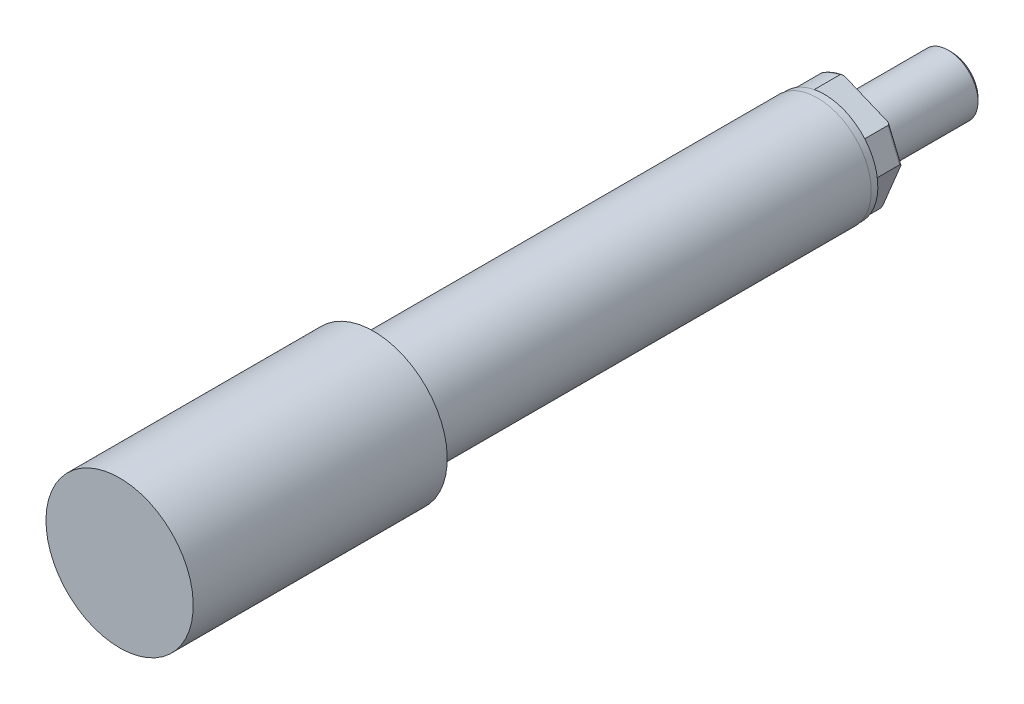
ISO-10303-21;
HEADER;
FILE_DESCRIPTION(('STEP AP214'),'2;1');
FILE_NAME('part.step','',(''),(''),'','','');
FILE_SCHEMA(('AUTOMOTIVE_DESIGN { 1 0 10303 214 1 1 1 1 }'));
ENDSEC;
DATA;
#1=APPLICATION_CONTEXT('core data for automotive mechanical design processes');
#2=APPLICATION_PROTOCOL_DEFINITION('international standard','automotive_design',2000,#1);
#3=PRODUCT_CONTEXT('',#1,'mechanical');
#4=PRODUCT('Part','Part','',(#3));
#5=PRODUCT_RELATED_PRODUCT_CATEGORY('part','',(#4));
#6=PRODUCT_DEFINITION_FORMATION('','',#4);
#7=PRODUCT_DEFINITION_CONTEXT('part definition',#1,'design');
#8=PRODUCT_DEFINITION('design','',#6,#7);
#9=PRODUCT_DEFINITION_SHAPE('','',#8);
#10=(LENGTH_UNIT() NAMED_UNIT(*) SI_UNIT(.MILLI.,.METRE.));
#11=(NAMED_UNIT(*) PLANE_ANGLE_UNIT() SI_UNIT($,.RADIAN.));
#12=(NAMED_UNIT(*) SI_UNIT($,.STERADIAN.) SOLID_ANGLE_UNIT());
#13=UNCERTAINTY_MEASURE_WITH_UNIT(LENGTH_MEASURE(1.E-05),#10,'distance_accuracy_value','');
#14=(GEOMETRIC_REPRESENTATION_CONTEXT(3) GLOBAL_UNCERTAINTY_ASSIGNED_CONTEXT((#13)) GLOBAL_UNIT_ASSIGNED_CONTEXT((#10,
#11,#12)) REPRESENTATION_CONTEXT('',''));
#15=CARTESIAN_POINT('',(0.,0.,0.));
#16=DIRECTION('',(0.,0.,1.));
#17=DIRECTION('',(1.,0.,0.));
#18=AXIS2_PLACEMENT_3D('',#15,#16,#17);
#19=CARTESIAN_POINT('',(0.,0.,-287.8328));
#20=DIRECTION('',(0.,0.,1.));
#21=DIRECTION('',(0.923879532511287,-0.382683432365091,0.));
#22=AXIS2_PLACEMENT_3D('',#19,#20,#21);
#23=CYLINDRICAL_SURFACE('',#22,37.719);
#24=CARTESIAN_POINT('',(0.,0.,-347.98));
#25=DIRECTION('',(0.,0.,1.));
#26=DIRECTION('',(0.923879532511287,-0.382683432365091,0.));
#27=AXIS2_PLACEMENT_3D('',#24,#25,#26);
#28=CIRCLE('',#27,37.719);
#29=CARTESIAN_POINT('',(34.8478120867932,-14.4344363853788,-347.98));
#30=VERTEX_POINT('',#29);
#31=EDGE_CURVE('E137',#30,#30,#28,.T.);
#32=ORIENTED_EDGE('',*,*,#31,.F.);
#33=EDGE_LOOP('',(#32));
#34=FACE_BOUND('',#33,.T.);
#35=CARTESIAN_POINT('',(0.,0.,-352.98));
#36=DIRECTION('',(0.,0.,-1.));
#37=DIRECTION('',(-0.923879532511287,0.382683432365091,0.));
#38=AXIS2_PLACEMENT_3D('',#35,#36,#37);
#39=CIRCLE('',#38,37.719);
#40=CARTESIAN_POINT('',(-34.8478120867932,14.4344363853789,-352.98));
#41=VERTEX_POINT('',#40);
#42=EDGE_CURVE('E173',#41,#41,#39,.T.);
#43=ORIENTED_EDGE('',*,*,#42,.F.);
#44=EDGE_LOOP('',(#43));
#45=FACE_BOUND('',#44,.T.);
#46=ADVANCED_FACE('F16',(#34,#45),#23,.T.);
#47=CARTESIAN_POINT('',(14.4344363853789,34.8478120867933,-372.98));
#48=DIRECTION('',(0.,0.,1.));
#49=DIRECTION('',(0.923879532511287,-0.382683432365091,0.));
#50=AXIS2_PLACEMENT_3D('',#47,#48,#49);
#51=PLANE('',#50);
#52=CARTESIAN_POINT('',(0.,0.,-372.98));
#53=DIRECTION('',(0.,0.,1.));
#54=DIRECTION('',(0.923879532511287,-0.382683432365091,0.));
#55=AXIS2_PLACEMENT_3D('',#52,#53,#54);
#56=CIRCLE('',#55,18.495999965);
#57=CARTESIAN_POINT('',(17.088075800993,-7.07811275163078,-372.98));
#58=VERTEX_POINT('',#57);
#59=EDGE_CURVE('E158',#58,#58,#56,.T.);
#60=ORIENTED_EDGE('',*,*,#59,.T.);
#61=EDGE_LOOP('',(#60));
#62=FACE_BOUND('',#61,.T.);
#63=DIRECTION('',(0.923879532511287,-0.382683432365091,0.));
#64=VECTOR('',#63,1.);
#65=CARTESIAN_POINT('',(40.5034519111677,16.7770791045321,-372.98));
#66=LINE('',#65,#64);
#67=CARTESIAN_POINT('',(-4.93911886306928,35.6000082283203,-372.98));
#68=VERTEX_POINT('',#67);
#69=CARTESIAN_POINT('',(24.3744280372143,23.4579395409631,-372.98));
#70=VERTEX_POINT('',#69);
#71=EDGE_CURVE('E153',#68,#70,#66,.T.);
#72=ORIENTED_EDGE('',*,*,#71,.T.);
#73=DIRECTION('',(-0.382683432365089,0.923879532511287,0.));
#74=VECTOR('',#73,1.);
#75=CARTESIAN_POINT('',(18.8918219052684,36.6941216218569,-372.98));
#76=LINE('',#75,#74);
#77=CARTESIAN_POINT('',(33.8225914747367,0.648055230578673,-372.98));
#78=VERTEX_POINT('',#77);
#79=EDGE_CURVE('E269',#70,#78,#76,.F.);
#80=ORIENTED_EDGE('',*,*,#79,.T.);
#81=DIRECTION('',(-0.382683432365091,-0.923879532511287,0.));
#82=VECTOR('',#81,1.);
#83=CARTESIAN_POINT('',(40.5034519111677,16.7770791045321,-372.98));
#84=LINE('',#83,#82);
#85=CARTESIAN_POINT('',(21.6805227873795,-28.6654916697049,-372.98));
#86=VERTEX_POINT('',#85);
#87=EDGE_CURVE('E143',#78,#86,#84,.T.);
#88=ORIENTED_EDGE('',*,*,#87,.T.);
#89=CARTESIAN_POINT('',(0.,0.,-372.98));
#90=DIRECTION('',(0.,0.,1.));
#91=DIRECTION('',(0.923879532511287,-0.382683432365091,0.));
#92=AXIS2_PLACEMENT_3D('',#89,#90,#91);
#93=CIRCLE('',#92,35.941);
#94=CARTESIAN_POINT('',(4.93911886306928,-35.6000082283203,-372.98));
#95=VERTEX_POINT('',#94);
#96=EDGE_CURVE('E284',#86,#95,#93,.F.);
#97=ORIENTED_EDGE('',*,*,#96,.T.);
#98=DIRECTION('',(-0.923879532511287,0.382683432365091,0.));
#99=VECTOR('',#98,1.);
#100=CARTESIAN_POINT('',(16.7770791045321,-40.5034519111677,-372.98));
#101=LINE('',#100,#99);
#102=CARTESIAN_POINT('',(-28.6654916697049,-21.6805227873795,-372.98));
#103=VERTEX_POINT('',#102);
#104=EDGE_CURVE('E146',#95,#103,#101,.T.);
#105=ORIENTED_EDGE('',*,*,#104,.T.);
#106=CARTESIAN_POINT('',(0.,0.,-372.98));
#107=DIRECTION('',(0.,0.,1.));
#108=DIRECTION('',(0.923879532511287,-0.382683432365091,0.));
#109=AXIS2_PLACEMENT_3D('',#106,#107,#108);
#110=CIRCLE('',#109,35.941);
#111=CARTESIAN_POINT('',(-35.6000082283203,-4.93911886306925,-372.98));
#112=VERTEX_POINT('',#111);
#113=EDGE_CURVE('E282',#103,#112,#110,.F.);
#114=ORIENTED_EDGE('',*,*,#113,.T.);
#115=DIRECTION('',(0.382683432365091,0.923879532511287,0.));
#116=VECTOR('',#115,1.);
#117=CARTESIAN_POINT('',(-16.777079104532,40.5034519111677,-372.98));
#118=LINE('',#117,#116);
#119=CARTESIAN_POINT('',(-21.6805227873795,28.6654916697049,-372.98));
#120=VERTEX_POINT('',#119);
#121=EDGE_CURVE('E150',#112,#120,#118,.T.);
#122=ORIENTED_EDGE('',*,*,#121,.T.);
#123=CARTESIAN_POINT('',(0.,0.,-372.98));
#124=DIRECTION('',(0.,0.,1.));
#125=DIRECTION('',(0.923879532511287,-0.382683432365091,0.));
#126=AXIS2_PLACEMENT_3D('',#123,#124,#125);
#127=CIRCLE('',#126,35.941);
#128=EDGE_CURVE('E285',#120,#68,#127,.F.);
#129=ORIENTED_EDGE('',*,*,#128,.T.);
#130=EDGE_LOOP('',(#72,#80,#88,#97,#105,#114,#122,#129));
#131=FACE_BOUND('',#130,.T.);
#132=ADVANCED_FACE('F235',(#62,#131),#51,.F.);
#133=CARTESIAN_POINT('',(16.7770791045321,-40.5034519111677,-352.98));
#134=DIRECTION('',(-0.382683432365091,-0.923879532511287,0.));
#135=DIRECTION('',(0.,0.,-1.));
#136=AXIS2_PLACEMENT_3D('',#133,#134,#135);
#137=PLANE('',#136);
#138=ORIENTED_EDGE('',*,*,#104,.F.);
#139=CARTESIAN_POINT('',(4.93911886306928,-35.6000082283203,-372.98));
#140=CARTESIAN_POINT('',(4.99832987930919,-35.6245342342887,-372.979997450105));
#141=CARTESIAN_POINT('',(5.05753718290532,-35.6490587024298,-372.978965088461));
#142=CARTESIAN_POINT('',(5.17589592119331,-35.698084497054,-372.974771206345));
#143=CARTESIAN_POINT('',(5.23504734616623,-35.7225858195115,-372.971609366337));
#144=CARTESIAN_POINT('',(5.41269190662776,-35.7961686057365,-372.958798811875));
#145=CARTESIAN_POINT('',(5.53100031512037,-35.8451735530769,-372.945824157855));
#146=CARTESIAN_POINT('',(5.76714438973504,-35.9429876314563,-372.910075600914));
#147=CARTESIAN_POINT('',(5.88497196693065,-35.9917934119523,-372.887238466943));
#148=CARTESIAN_POINT('',(6.11821347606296,-36.0884052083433,-372.830530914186));
#149=CARTESIAN_POINT('',(6.23363092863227,-36.1362126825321,-372.796677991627));
#150=CARTESIAN_POINT('',(6.43254813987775,-36.2186068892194,-372.726075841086));
#151=CARTESIAN_POINT('',(6.51688700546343,-36.2535411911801,-372.69210972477));
#152=CARTESIAN_POINT('',(6.6823092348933,-36.322061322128,-372.615821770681));
#153=CARTESIAN_POINT('',(6.76339350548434,-36.3556475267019,-372.573502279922));
#154=CARTESIAN_POINT('',(6.92130537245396,-36.4210567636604,-372.478775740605));
#155=CARTESIAN_POINT('',(6.99809311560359,-36.452863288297,-372.426289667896));
#156=CARTESIAN_POINT('',(7.14387346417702,-36.5132474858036,-372.309776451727));
#157=CARTESIAN_POINT('',(7.21288086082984,-36.5418312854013,-372.245771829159));
#158=CARTESIAN_POINT('',(7.31526105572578,-36.5842385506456,-372.130741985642));
#159=CARTESIAN_POINT('',(7.35238511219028,-36.5996158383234,-372.083646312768));
#160=CARTESIAN_POINT('',(7.41994876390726,-36.6276016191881,-371.984077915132));
#161=CARTESIAN_POINT('',(7.45039435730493,-36.6402125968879,-371.931610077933));
#162=CARTESIAN_POINT('',(7.49865078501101,-36.6602010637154,-371.829833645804));
#163=CARTESIAN_POINT('',(7.51766185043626,-36.6680757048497,-371.781197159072));
#164=CARTESIAN_POINT('',(7.5478905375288,-36.6805968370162,-371.68119484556));
#165=CARTESIAN_POINT('',(7.55912658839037,-36.6852509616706,-371.629835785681));
#166=CARTESIAN_POINT('',(7.56865990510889,-36.6891997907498,-371.557679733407));
#167=CARTESIAN_POINT('',(7.57066753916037,-36.6900313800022,-371.537405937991));
#168=CARTESIAN_POINT('',(7.57334922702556,-36.691142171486,-371.496758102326));
#169=CARTESIAN_POINT('',(7.57402345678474,-36.6914214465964,-371.476384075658));
#170=CARTESIAN_POINT('',(7.57402314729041,-36.6914213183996,-371.456));
#171=B_SPLINE_CURVE_WITH_KNOTS('',3,(#139,#140,#141,#142,#143,#144,#145,#146,#147,#148,#149,
#150,#151,#152,#153,#154,#155,#156,#157,#158,#159,#160,#161,#162,#163,#164,#165,#166,#167,#168,
#169,#170),.UNSPECIFIED.,.F.,.F.,(4,2,2,2,2,2,2,2,2,2,2,2,2,2,2,4),(0.,0.192251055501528,
0.384530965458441,0.77030604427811,1.15859203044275,1.54626429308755,1.83813426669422,
2.12992235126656,2.42407675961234,2.71766216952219,2.90288017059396,3.08793113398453,
3.24573831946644,3.40317015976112,3.46429781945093,3.5254174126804),.UNSPECIFIED.);
#172=CARTESIAN_POINT('',(7.5740231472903,-36.6914213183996,-371.456));
#173=VERTEX_POINT('',#172);
#174=EDGE_CURVE('E248',#95,#173,#171,.T.);
#175=ORIENTED_EDGE('',*,*,#174,.T.);
#176=DIRECTION('',(0.,0.,-1.));
#177=VECTOR('',#176,1.);
#178=CARTESIAN_POINT('',(7.57402314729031,-36.6914213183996,-245.227702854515));
#179=LINE('',#178,#177);
#180=CARTESIAN_POINT('',(7.5740231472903,-36.6914213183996,-352.98));
#181=VERTEX_POINT('',#180);
#182=EDGE_CURVE('E316',#173,#181,#179,.F.);
#183=ORIENTED_EDGE('',*,*,#182,.T.);
#184=DIRECTION('',(-0.923879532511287,0.382683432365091,0.));
#185=VECTOR('',#184,1.);
#186=CARTESIAN_POINT('',(16.7770791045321,-40.5034519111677,-352.98));
#187=LINE('',#186,#185);
#188=CARTESIAN_POINT('',(-31.3003959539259,-20.5891096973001,-352.98));
#189=VERTEX_POINT('',#188);
#190=EDGE_CURVE('E134',#181,#189,#187,.T.);
#191=ORIENTED_EDGE('',*,*,#190,.T.);
#192=DIRECTION('',(0.,0.,-1.));
#193=VECTOR('',#192,1.);
#194=CARTESIAN_POINT('',(-31.3003959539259,-20.5891096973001,-245.227702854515));
#195=LINE('',#194,#193);
#196=CARTESIAN_POINT('',(-31.3003959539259,-20.5891096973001,-371.456));
#197=VERTEX_POINT('',#196);
#198=EDGE_CURVE('E121',#189,#197,#195,.T.);
#199=ORIENTED_EDGE('',*,*,#198,.T.);
#200=CARTESIAN_POINT('',(-31.3003959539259,-20.5891096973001,-371.456));
#201=CARTESIAN_POINT('',(-31.3004118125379,-20.5891031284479,-371.486203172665));
#202=CARTESIAN_POINT('',(-31.2989193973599,-20.5897213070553,-371.516395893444));
#203=CARTESIAN_POINT('',(-31.2930415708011,-20.5921559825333,-371.576407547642));
#204=CARTESIAN_POINT('',(-31.2886603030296,-20.5939707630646,-371.606226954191));
#205=CARTESIAN_POINT('',(-31.2772021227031,-20.598716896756,-371.664846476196));
#206=CARTESIAN_POINT('',(-31.270160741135,-20.6016335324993,-371.693654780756));
#207=CARTESIAN_POINT('',(-31.2535839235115,-20.60849987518,-371.750415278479));
#208=CARTESIAN_POINT('',(-31.2440477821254,-20.6124498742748,-371.778367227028));
#209=CARTESIAN_POINT('',(-31.2121642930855,-20.6256564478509,-371.860335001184));
#210=CARTESIAN_POINT('',(-31.1864612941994,-20.6363029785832,-371.912849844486));
#211=CARTESIAN_POINT('',(-31.1279804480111,-20.6605265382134,-372.013146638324));
#212=CARTESIAN_POINT('',(-31.0951775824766,-20.6741139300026,-372.060910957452));
#213=CARTESIAN_POINT('',(-31.003724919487,-20.711994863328,-372.177743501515));
#214=CARTESIAN_POINT('',(-30.9410998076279,-20.7379350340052,-372.243153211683));
#215=CARTESIAN_POINT('',(-30.8074439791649,-20.7932970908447,-372.362855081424));
#216=CARTESIAN_POINT('',(-30.7363963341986,-20.8227259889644,-372.417124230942));
#217=CARTESIAN_POINT('',(-30.5996359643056,-20.8793739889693,-372.508806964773));
#218=CARTESIAN_POINT('',(-30.5346551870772,-20.9062899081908,-372.547524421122));
#219=CARTESIAN_POINT('',(-30.4018382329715,-20.9613044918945,-372.61879354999));
#220=CARTESIAN_POINT('',(-30.3339999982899,-20.989404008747,-372.651340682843));
#221=CARTESIAN_POINT('',(-30.1960424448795,-21.0465478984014,-372.711059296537));
#222=CARTESIAN_POINT('',(-30.1259151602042,-21.0755955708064,-372.738208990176));
#223=CARTESIAN_POINT('',(-29.9841814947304,-21.1343035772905,-372.787552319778));
#224=CARTESIAN_POINT('',(-29.9125747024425,-21.1639640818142,-372.809744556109));
#225=CARTESIAN_POINT('',(-29.7438693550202,-21.2338441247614,-372.856387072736));
#226=CARTESIAN_POINT('',(-29.646350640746,-21.2742376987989,-372.879056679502));
#227=CARTESIAN_POINT('',(-29.4500861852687,-21.3555330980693,-372.917195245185));
#228=CARTESIAN_POINT('',(-29.3513397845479,-21.3964351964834,-372.932660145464));
#229=CARTESIAN_POINT('',(-29.1548151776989,-21.4778383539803,-372.956800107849));
#230=CARTESIAN_POINT('',(-29.0570481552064,-21.5183347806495,-372.965583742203));
#231=CARTESIAN_POINT('',(-28.861343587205,-21.5993982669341,-372.977167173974));
#232=CARTESIAN_POINT('',(-28.7634064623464,-21.6399651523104,-372.97997520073));
#233=CARTESIAN_POINT('',(-28.6654916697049,-21.6805227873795,-372.98));
#234=B_SPLINE_CURVE_WITH_KNOTS('',3,(#200,#201,#202,#203,#204,#205,#206,#207,#208,#209,#210,
#211,#212,#213,#214,#215,#216,#217,#218,#219,#220,#221,#222,#223,#224,#225,#226,#227,#228,#229,
#230,#231,#232,#233),.UNSPECIFIED.,.F.,.F.,(4,2,2,2,2,2,2,2,2,2,2,2,2,2,2,2,4),(0.,
0.0905495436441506,0.180969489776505,0.270222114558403,0.359500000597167,0.536883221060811,
0.714901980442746,0.995893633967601,1.27745994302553,1.5179835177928,1.75868337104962,
2.00033593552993,2.24205663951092,2.56564116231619,2.88940775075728,3.20779349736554,
3.52574049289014),.UNSPECIFIED.);
#235=EDGE_CURVE('E242',#197,#103,#234,.T.);
#236=ORIENTED_EDGE('',*,*,#235,.T.);
#237=EDGE_LOOP('',(#138,#175,#183,#191,#199,#236));
#238=FACE_BOUND('',#237,.T.);
#239=ADVANCED_FACE('F230',(#238),#137,.T.);
#240=CARTESIAN_POINT('',(-16.777079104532,40.5034519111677,-352.98));
#241=DIRECTION('',(-0.923879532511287,0.382683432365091,0.));
#242=DIRECTION('',(-0.382683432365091,-0.923879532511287,0.));
#243=AXIS2_PLACEMENT_3D('',#240,#241,#242);
#244=PLANE('',#243);
#245=ORIENTED_EDGE('',*,*,#121,.F.);
#246=CARTESIAN_POINT('',(-35.6000082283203,-4.93911886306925,-372.98));
#247=CARTESIAN_POINT('',(-35.6245342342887,-4.99832987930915,-372.979997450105));
#248=CARTESIAN_POINT('',(-35.6490587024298,-5.05753718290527,-372.978965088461));
#249=CARTESIAN_POINT('',(-35.6980844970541,-5.17589592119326,-372.974771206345));
#250=CARTESIAN_POINT('',(-35.7225858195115,-5.23504734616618,-372.971609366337));
#251=CARTESIAN_POINT('',(-35.7961686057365,-5.41269190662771,-372.958798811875));
#252=CARTESIAN_POINT('',(-35.8451735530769,-5.53100031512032,-372.945824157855));
#253=CARTESIAN_POINT('',(-35.9429876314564,-5.767144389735,-372.910075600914));
#254=CARTESIAN_POINT('',(-35.9917934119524,-5.88497196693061,-372.887238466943));
#255=CARTESIAN_POINT('',(-36.0884052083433,-6.11821347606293,-372.830530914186));
#256=CARTESIAN_POINT('',(-36.1362126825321,-6.23363092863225,-372.796677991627));
#257=CARTESIAN_POINT('',(-36.2186068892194,-6.43254813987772,-372.726075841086));
#258=CARTESIAN_POINT('',(-36.2535411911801,-6.51688700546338,-372.69210972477));
#259=CARTESIAN_POINT('',(-36.322061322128,-6.68230923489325,-372.615821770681));
#260=CARTESIAN_POINT('',(-36.3556475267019,-6.76339350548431,-372.573502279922));
#261=CARTESIAN_POINT('',(-36.4210567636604,-6.92130537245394,-372.478775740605));
#262=CARTESIAN_POINT('',(-36.452863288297,-6.99809311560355,-372.426289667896));
#263=CARTESIAN_POINT('',(-36.5132474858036,-7.14387346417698,-372.309776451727));
#264=CARTESIAN_POINT('',(-36.5418312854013,-7.21288086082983,-372.245771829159));
#265=CARTESIAN_POINT('',(-36.5842385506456,-7.31526105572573,-372.130741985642));
#266=CARTESIAN_POINT('',(-36.5996158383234,-7.35238511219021,-372.083646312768));
#267=CARTESIAN_POINT('',(-36.6276016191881,-7.4199487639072,-371.984077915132));
#268=CARTESIAN_POINT('',(-36.6402125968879,-7.4503943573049,-371.931610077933));
#269=CARTESIAN_POINT('',(-36.6602010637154,-7.49865078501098,-371.829833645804));
#270=CARTESIAN_POINT('',(-36.6680757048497,-7.51766185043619,-371.781197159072));
#271=CARTESIAN_POINT('',(-36.6805968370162,-7.54789053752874,-371.68119484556));
#272=CARTESIAN_POINT('',(-36.6852509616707,-7.55912658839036,-371.629835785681));
#273=CARTESIAN_POINT('',(-36.6891997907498,-7.56865990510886,-371.557679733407));
#274=CARTESIAN_POINT('',(-36.6900313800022,-7.57066753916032,-371.537405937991));
#275=CARTESIAN_POINT('',(-36.691142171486,-7.5733492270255,-371.496758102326));
#276=CARTESIAN_POINT('',(-36.6914214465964,-7.57402345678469,-371.476384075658));
#277=CARTESIAN_POINT('',(-36.6914213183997,-7.57402314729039,-371.456));
#278=B_SPLINE_CURVE_WITH_KNOTS('',3,(#246,#247,#248,#249,#250,#251,#252,#253,#254,#255,#256,
#257,#258,#259,#260,#261,#262,#263,#264,#265,#266,#267,#268,#269,#270,#271,#272,#273,#274,#275,
#276,#277),.UNSPECIFIED.,.F.,.F.,(4,2,2,2,2,2,2,2,2,2,2,2,2,2,2,4),(0.,0.192251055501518,
0.384530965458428,0.770306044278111,1.15859203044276,1.54626429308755,1.83813426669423,
2.12992235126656,2.42407675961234,2.71766216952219,2.90288017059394,3.08793113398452,
3.24573831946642,3.40317015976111,3.46429781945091,3.52541741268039),.UNSPECIFIED.);
#279=CARTESIAN_POINT('',(-36.6914213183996,-7.57402314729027,-371.456));
#280=VERTEX_POINT('',#279);
#281=EDGE_CURVE('E33',#112,#280,#278,.T.);
#282=ORIENTED_EDGE('',*,*,#281,.T.);
#283=DIRECTION('',(0.,0.,-1.));
#284=VECTOR('',#283,1.);
#285=CARTESIAN_POINT('',(-36.6914213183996,-7.57402314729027,-245.227702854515));
#286=LINE('',#285,#284);
#287=CARTESIAN_POINT('',(-36.6914213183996,-7.57402314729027,-352.98));
#288=VERTEX_POINT('',#287);
#289=EDGE_CURVE('E107',#280,#288,#286,.F.);
#290=ORIENTED_EDGE('',*,*,#289,.T.);
#291=DIRECTION('',(0.382683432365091,0.923879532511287,0.));
#292=VECTOR('',#291,1.);
#293=CARTESIAN_POINT('',(-16.777079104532,40.5034519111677,-352.98));
#294=LINE('',#293,#292);
#295=CARTESIAN_POINT('',(-20.5891096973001,31.3003959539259,-352.98));
#296=VERTEX_POINT('',#295);
#297=EDGE_CURVE('E111',#288,#296,#294,.T.);
#298=ORIENTED_EDGE('',*,*,#297,.T.);
#299=DIRECTION('',(0.,0.,-1.));
#300=VECTOR('',#299,1.);
#301=CARTESIAN_POINT('',(-20.5891096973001,31.3003959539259,-245.227702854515));
#302=LINE('',#301,#300);
#303=CARTESIAN_POINT('',(-20.5891096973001,31.3003959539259,-371.456));
#304=VERTEX_POINT('',#303);
#305=EDGE_CURVE('E114',#296,#304,#302,.T.);
#306=ORIENTED_EDGE('',*,*,#305,.T.);
#307=CARTESIAN_POINT('',(-20.5891096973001,31.3003959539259,-371.456));
#308=CARTESIAN_POINT('',(-20.5891031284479,31.300411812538,-371.486203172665));
#309=CARTESIAN_POINT('',(-20.5897213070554,31.2989193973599,-371.516395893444));
#310=CARTESIAN_POINT('',(-20.5921559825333,31.2930415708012,-371.576407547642));
#311=CARTESIAN_POINT('',(-20.5939707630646,31.2886603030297,-371.606226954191));
#312=CARTESIAN_POINT('',(-20.598716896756,31.2772021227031,-371.664846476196));
#313=CARTESIAN_POINT('',(-20.6016335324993,31.270160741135,-371.693654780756));
#314=CARTESIAN_POINT('',(-20.60849987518,31.2535839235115,-371.750415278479));
#315=CARTESIAN_POINT('',(-20.6124498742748,31.2440477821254,-371.778367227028));
#316=CARTESIAN_POINT('',(-20.6256564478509,31.2121642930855,-371.860335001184));
#317=CARTESIAN_POINT('',(-20.6363029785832,31.1864612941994,-371.912849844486));
#318=CARTESIAN_POINT('',(-20.6605265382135,31.1279804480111,-372.013146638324));
#319=CARTESIAN_POINT('',(-20.6741139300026,31.0951775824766,-372.060910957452));
#320=CARTESIAN_POINT('',(-20.711994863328,31.003724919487,-372.177743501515));
#321=CARTESIAN_POINT('',(-20.7379350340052,30.9410998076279,-372.243153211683));
#322=CARTESIAN_POINT('',(-20.7932970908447,30.8074439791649,-372.362855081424));
#323=CARTESIAN_POINT('',(-20.8227259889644,30.7363963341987,-372.417124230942));
#324=CARTESIAN_POINT('',(-20.8793739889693,30.5996359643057,-372.508806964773));
#325=CARTESIAN_POINT('',(-20.9062899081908,30.5346551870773,-372.547524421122));
#326=CARTESIAN_POINT('',(-20.9613044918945,30.4018382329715,-372.61879354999));
#327=CARTESIAN_POINT('',(-20.989404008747,30.3339999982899,-372.651340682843));
#328=CARTESIAN_POINT('',(-21.0465478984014,30.1960424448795,-372.711059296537));
#329=CARTESIAN_POINT('',(-21.0755955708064,30.1259151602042,-372.738208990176));
#330=CARTESIAN_POINT('',(-21.1343035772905,29.9841814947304,-372.787552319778));
#331=CARTESIAN_POINT('',(-21.1639640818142,29.9125747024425,-372.809744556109));
#332=CARTESIAN_POINT('',(-21.2338441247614,29.7438693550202,-372.856387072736));
#333=CARTESIAN_POINT('',(-21.2742376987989,29.646350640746,-372.879056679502));
#334=CARTESIAN_POINT('',(-21.3555330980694,29.4500861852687,-372.917195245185));
#335=CARTESIAN_POINT('',(-21.3964351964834,29.3513397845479,-372.932660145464));
#336=CARTESIAN_POINT('',(-21.4778383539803,29.154815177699,-372.956800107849));
#337=CARTESIAN_POINT('',(-21.5183347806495,29.0570481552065,-372.965583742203));
#338=CARTESIAN_POINT('',(-21.5993982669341,28.861343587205,-372.977167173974));
#339=CARTESIAN_POINT('',(-21.6399651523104,28.7634064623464,-372.97997520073));
#340=CARTESIAN_POINT('',(-21.6805227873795,28.6654916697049,-372.98));
#341=B_SPLINE_CURVE_WITH_KNOTS('',3,(#307,#308,#309,#310,#311,#312,#313,#314,#315,#316,#317,
#318,#319,#320,#321,#322,#323,#324,#325,#326,#327,#328,#329,#330,#331,#332,#333,#334,#335,#336,
#337,#338,#339,#340),.UNSPECIFIED.,.F.,.F.,(4,2,2,2,2,2,2,2,2,2,2,2,2,2,2,2,4),(0.,
0.0905495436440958,0.180969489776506,0.270222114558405,0.359500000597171,0.536883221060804,
0.714901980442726,0.995893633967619,1.27745994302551,1.51798351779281,1.75868337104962,
2.00033593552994,2.24205663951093,2.5656411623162,2.8894077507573,3.20779349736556,
3.52574049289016),.UNSPECIFIED.);
#342=EDGE_CURVE('E213',#304,#120,#341,.T.);
#343=ORIENTED_EDGE('',*,*,#342,.T.);
#344=EDGE_LOOP('',(#245,#282,#290,#298,#306,#343));
#345=FACE_BOUND('',#344,.T.);
#346=ADVANCED_FACE('F109',(#345),#244,.T.);
#347=CARTESIAN_POINT('',(40.5034519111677,16.7770791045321,-352.98));
#348=DIRECTION('',(0.382683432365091,0.923879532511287,0.));
#349=DIRECTION('',(0.,0.,1.));
#350=AXIS2_PLACEMENT_3D('',#347,#348,#349);
#351=PLANE('',#350);
#352=DIRECTION('',(0.,0.,1.));
#353=VECTOR('',#352,1.);
#354=CARTESIAN_POINT('',(26.3656299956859,22.6331566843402,-352.98));
#355=LINE('',#354,#353);
#356=CARTESIAN_POINT('',(26.3656299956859,22.6331566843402,-371.456));
#357=VERTEX_POINT('',#356);
#358=CARTESIAN_POINT('',(26.3656299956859,22.6331566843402,-352.98));
#359=VERTEX_POINT('',#358);
#360=EDGE_CURVE('E292',#357,#359,#355,.T.);
#361=ORIENTED_EDGE('',*,*,#360,.F.);
#362=CARTESIAN_POINT('',(24.3744280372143,23.4579395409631,-371.456));
#363=DIRECTION('',(0.382683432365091,0.923879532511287,0.));
#364=DIRECTION('',(-0.923879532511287,0.382683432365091,0.));
#365=AXIS2_PLACEMENT_3D('',#362,#363,#364);
#366=ELLIPSE('',#365,2.15526146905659,1.524);
#367=EDGE_CURVE('E193',#357,#70,#366,.T.);
#368=ORIENTED_EDGE('',*,*,#367,.T.);
#369=ORIENTED_EDGE('',*,*,#71,.F.);
#370=CARTESIAN_POINT('',(-4.93911886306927,35.6000082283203,-372.98));
#371=CARTESIAN_POINT('',(-4.99832987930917,35.6245342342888,-372.979997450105));
#372=CARTESIAN_POINT('',(-5.0575371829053,35.6490587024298,-372.978965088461));
#373=CARTESIAN_POINT('',(-5.17589592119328,35.6980844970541,-372.974771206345));
#374=CARTESIAN_POINT('',(-5.23504734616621,35.7225858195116,-372.971609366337));
#375=CARTESIAN_POINT('',(-5.41269190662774,35.7961686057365,-372.958798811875));
#376=CARTESIAN_POINT('',(-5.53100031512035,35.845173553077,-372.945824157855));
#377=CARTESIAN_POINT('',(-5.76714438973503,35.9429876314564,-372.910075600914));
#378=CARTESIAN_POINT('',(-5.88497196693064,35.9917934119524,-372.887238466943));
#379=CARTESIAN_POINT('',(-6.11821347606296,36.0884052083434,-372.830530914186));
#380=CARTESIAN_POINT('',(-6.23363092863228,36.1362126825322,-372.796677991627));
#381=CARTESIAN_POINT('',(-6.43254813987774,36.2186068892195,-372.726075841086));
#382=CARTESIAN_POINT('',(-6.5168870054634,36.2535411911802,-372.69210972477));
#383=CARTESIAN_POINT('',(-6.68230923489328,36.322061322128,-372.615821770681));
#384=CARTESIAN_POINT('',(-6.76339350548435,36.355647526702,-372.573502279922));
#385=CARTESIAN_POINT('',(-6.92130537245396,36.4210567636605,-372.478775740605));
#386=CARTESIAN_POINT('',(-6.99809311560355,36.452863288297,-372.426289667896));
#387=CARTESIAN_POINT('',(-7.14387346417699,36.5132474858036,-372.309776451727));
#388=CARTESIAN_POINT('',(-7.21288086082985,36.5418312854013,-372.245771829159));
#389=CARTESIAN_POINT('',(-7.31526105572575,36.5842385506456,-372.130741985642));
#390=CARTESIAN_POINT('',(-7.35238511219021,36.5996158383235,-372.083646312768));
#391=CARTESIAN_POINT('',(-7.4199487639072,36.6276016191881,-371.984077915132));
#392=CARTESIAN_POINT('',(-7.45039435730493,36.640212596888,-371.931610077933));
#393=CARTESIAN_POINT('',(-7.49865078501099,36.6602010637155,-371.829833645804));
#394=CARTESIAN_POINT('',(-7.51766185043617,36.6680757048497,-371.781197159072));
#395=CARTESIAN_POINT('',(-7.54789053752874,36.6805968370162,-371.68119484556));
#396=CARTESIAN_POINT('',(-7.5591265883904,36.6852509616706,-371.629835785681));
#397=CARTESIAN_POINT('',(-7.56865990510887,36.6891997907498,-371.557679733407));
#398=CARTESIAN_POINT('',(-7.57066753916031,36.6900313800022,-371.537405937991));
#399=CARTESIAN_POINT('',(-7.57334922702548,36.691142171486,-371.496758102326));
#400=CARTESIAN_POINT('',(-7.57402345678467,36.6914214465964,-371.476384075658));
#401=CARTESIAN_POINT('',(-7.5740231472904,36.6914213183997,-371.456));
#402=B_SPLINE_CURVE_WITH_KNOTS('',3,(#370,#371,#372,#373,#374,#375,#376,#377,#378,#379,#380,
#381,#382,#383,#384,#385,#386,#387,#388,#389,#390,#391,#392,#393,#394,#395,#396,#397,#398,#399,
#400,#401),.UNSPECIFIED.,.F.,.F.,(4,2,2,2,2,2,2,2,2,2,2,2,2,2,2,4),(0.,0.192251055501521,
0.384530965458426,0.770306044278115,1.15859203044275,1.54626429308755,1.83813426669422,
2.12992235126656,2.42407675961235,2.71766216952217,2.90288017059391,3.0879311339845,
3.24573831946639,3.40317015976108,3.46429781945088,3.52541741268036),.UNSPECIFIED.);
#403=CARTESIAN_POINT('',(-7.57402314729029,36.6914213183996,-371.456));
#404=VERTEX_POINT('',#403);
#405=EDGE_CURVE('E185',#68,#404,#402,.T.);
#406=ORIENTED_EDGE('',*,*,#405,.T.);
#407=DIRECTION('',(0.,0.,-1.));
#408=VECTOR('',#407,1.);
#409=CARTESIAN_POINT('',(-7.57402314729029,36.6914213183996,-245.227702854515));
#410=LINE('',#409,#408);
#411=CARTESIAN_POINT('',(-7.57402314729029,36.6914213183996,-352.98));
#412=VERTEX_POINT('',#411);
#413=EDGE_CURVE('E115',#404,#412,#410,.F.);
#414=ORIENTED_EDGE('',*,*,#413,.T.);
#415=DIRECTION('',(0.923879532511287,-0.382683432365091,0.));
#416=VECTOR('',#415,1.);
#417=CARTESIAN_POINT('',(40.5034519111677,16.7770791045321,-352.98));
#418=LINE('',#417,#416);
#419=EDGE_CURVE('E133',#412,#359,#418,.T.);
#420=ORIENTED_EDGE('',*,*,#419,.T.);
#421=EDGE_LOOP('',(#361,#368,#369,#406,#414,#420));
#422=FACE_BOUND('',#421,.T.);
#423=ADVANCED_FACE('F195',(#422),#351,.T.);
#424=CARTESIAN_POINT('',(40.5034519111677,16.7770791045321,-352.98));
#425=DIRECTION('',(0.923879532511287,-0.382683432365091,0.));
#426=DIRECTION('',(0.382683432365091,0.923879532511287,0.));
#427=AXIS2_PLACEMENT_3D('',#424,#425,#426);
#428=PLANE('',#427);
#429=ORIENTED_EDGE('',*,*,#87,.F.);
#430=CARTESIAN_POINT('',(33.8225914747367,0.648055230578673,-371.456));
#431=DIRECTION('',(0.923879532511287,-0.382683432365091,0.));
#432=DIRECTION('',(0.382683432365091,0.923879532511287,0.));
#433=AXIS2_PLACEMENT_3D('',#430,#431,#432);
#434=ELLIPSE('',#433,2.15526146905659,1.524);
#435=CARTESIAN_POINT('',(34.6473743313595,2.63925718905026,-371.456));
#436=VERTEX_POINT('',#435);
#437=EDGE_CURVE('E268',#78,#436,#434,.T.);
#438=ORIENTED_EDGE('',*,*,#437,.T.);
#439=DIRECTION('',(0.,0.,-1.));
#440=VECTOR('',#439,1.);
#441=CARTESIAN_POINT('',(34.6473743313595,2.63925718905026,-352.98));
#442=LINE('',#441,#440);
#443=CARTESIAN_POINT('',(34.6473743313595,2.63925718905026,-352.98));
#444=VERTEX_POINT('',#443);
#445=EDGE_CURVE('E176',#444,#436,#442,.T.);
#446=ORIENTED_EDGE('',*,*,#445,.F.);
#447=DIRECTION('',(-0.382683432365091,-0.923879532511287,0.));
#448=VECTOR('',#447,1.);
#449=CARTESIAN_POINT('',(40.5034519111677,16.7770791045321,-352.98));
#450=LINE('',#449,#448);
#451=CARTESIAN_POINT('',(20.5891096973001,-31.3003959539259,-352.98));
#452=VERTEX_POINT('',#451);
#453=EDGE_CURVE('E139',#444,#452,#450,.T.);
#454=ORIENTED_EDGE('',*,*,#453,.T.);
#455=DIRECTION('',(0.,0.,-1.));
#456=VECTOR('',#455,1.);
#457=CARTESIAN_POINT('',(20.5891096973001,-31.3003959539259,-245.227702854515));
#458=LINE('',#457,#456);
#459=CARTESIAN_POINT('',(20.5891096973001,-31.3003959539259,-371.456));
#460=VERTEX_POINT('',#459);
#461=EDGE_CURVE('E179',#452,#460,#458,.T.);
#462=ORIENTED_EDGE('',*,*,#461,.T.);
#463=CARTESIAN_POINT('',(20.5891096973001,-31.3003959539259,-371.456));
#464=CARTESIAN_POINT('',(20.589103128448,-31.3004118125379,-371.486203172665));
#465=CARTESIAN_POINT('',(20.5897213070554,-31.2989193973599,-371.516395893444));
#466=CARTESIAN_POINT('',(20.5921559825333,-31.2930415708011,-371.576407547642));
#467=CARTESIAN_POINT('',(20.5939707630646,-31.2886603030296,-371.606226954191));
#468=CARTESIAN_POINT('',(20.598716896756,-31.2772021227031,-371.664846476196));
#469=CARTESIAN_POINT('',(20.6016335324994,-31.270160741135,-371.693654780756));
#470=CARTESIAN_POINT('',(20.60849987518,-31.2535839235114,-371.750415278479));
#471=CARTESIAN_POINT('',(20.6124498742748,-31.2440477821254,-371.778367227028));
#472=CARTESIAN_POINT('',(20.6256564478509,-31.2121642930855,-371.860335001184));
#473=CARTESIAN_POINT('',(20.6363029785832,-31.1864612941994,-371.912849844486));
#474=CARTESIAN_POINT('',(20.6605265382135,-31.127980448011,-372.013146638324));
#475=CARTESIAN_POINT('',(20.6741139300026,-31.0951775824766,-372.060910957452));
#476=CARTESIAN_POINT('',(20.711994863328,-31.003724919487,-372.177743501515));
#477=CARTESIAN_POINT('',(20.7379350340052,-30.9410998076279,-372.243153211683));
#478=CARTESIAN_POINT('',(20.7932970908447,-30.8074439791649,-372.362855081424));
#479=CARTESIAN_POINT('',(20.8227259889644,-30.7363963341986,-372.417124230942));
#480=CARTESIAN_POINT('',(20.8793739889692,-30.5996359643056,-372.508806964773));
#481=CARTESIAN_POINT('',(20.9062899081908,-30.5346551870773,-372.547524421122));
#482=CARTESIAN_POINT('',(20.9613044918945,-30.4018382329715,-372.61879354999));
#483=CARTESIAN_POINT('',(20.9894040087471,-30.3339999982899,-372.651340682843));
#484=CARTESIAN_POINT('',(21.0465478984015,-30.1960424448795,-372.711059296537));
#485=CARTESIAN_POINT('',(21.0755955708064,-30.1259151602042,-372.738208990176));
#486=CARTESIAN_POINT('',(21.1343035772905,-29.9841814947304,-372.787552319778));
#487=CARTESIAN_POINT('',(21.1639640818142,-29.9125747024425,-372.809744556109));
#488=CARTESIAN_POINT('',(21.2338441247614,-29.7438693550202,-372.856387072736));
#489=CARTESIAN_POINT('',(21.2742376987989,-29.646350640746,-372.879056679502));
#490=CARTESIAN_POINT('',(21.3555330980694,-29.4500861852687,-372.917195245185));
#491=CARTESIAN_POINT('',(21.3964351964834,-29.3513397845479,-372.932660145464));
#492=CARTESIAN_POINT('',(21.4778383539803,-29.1548151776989,-372.956800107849));
#493=CARTESIAN_POINT('',(21.5183347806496,-29.0570481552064,-372.965583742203));
#494=CARTESIAN_POINT('',(21.5993982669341,-28.861343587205,-372.977167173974));
#495=CARTESIAN_POINT('',(21.6399651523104,-28.7634064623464,-372.97997520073));
#496=CARTESIAN_POINT('',(21.6805227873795,-28.6654916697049,-372.98));
#497=B_SPLINE_CURVE_WITH_KNOTS('',3,(#463,#464,#465,#466,#467,#468,#469,#470,#471,#472,#473,
#474,#475,#476,#477,#478,#479,#480,#481,#482,#483,#484,#485,#486,#487,#488,#489,#490,#491,#492,
#493,#494,#495,#496),.UNSPECIFIED.,.F.,.F.,(4,2,2,2,2,2,2,2,2,2,2,2,2,2,2,2,4),(0.,
0.0905495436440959,0.180969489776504,0.270222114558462,0.359500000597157,0.53688322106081,
0.714901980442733,0.995893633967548,1.27745994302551,1.51798351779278,1.75868337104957,
2.00033593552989,2.2420566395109,2.56564116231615,2.88940775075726,3.20779349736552,
3.52574049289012),.UNSPECIFIED.);
#498=EDGE_CURVE('E262',#460,#86,#497,.T.);
#499=ORIENTED_EDGE('',*,*,#498,.T.);
#500=EDGE_LOOP('',(#429,#438,#446,#454,#462,#499));
#501=FACE_BOUND('',#500,.T.);
#502=ADVANCED_FACE('F237',(#501),#428,.T.);
#503=CARTESIAN_POINT('',(0.,0.,-442.83));
#504=DIRECTION('',(0.,0.,1.));
#505=DIRECTION('',(0.923879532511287,-0.382683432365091,0.));
#506=AXIS2_PLACEMENT_3D('',#503,#504,#505);
#507=PLANE('',#506);
#508=CARTESIAN_POINT('',(0.,0.,-442.83));
#509=DIRECTION('',(0.,0.,1.));
#510=DIRECTION('',(0.923879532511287,-0.382683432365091,0.));
#511=AXIS2_PLACEMENT_3D('',#508,#509,#510);
#512=CIRCLE('',#511,2.9845);
#513=CARTESIAN_POINT('',(2.75731846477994,-1.14211870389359,-442.83));
#514=VERTEX_POINT('',#513);
#515=EDGE_CURVE('E147',#514,#514,#512,.T.);
#516=ORIENTED_EDGE('',*,*,#515,.T.);
#517=EDGE_LOOP('',(#516));
#518=FACE_BOUND('',#517,.T.);
#519=CARTESIAN_POINT('',(0.,0.,-442.83));
#520=DIRECTION('',(0.,0.,1.));
#521=DIRECTION('',(0.923879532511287,-0.382683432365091,0.));
#522=AXIS2_PLACEMENT_3D('',#519,#520,#521);
#523=CIRCLE('',#522,18.714);
#524=CARTESIAN_POINT('',(17.2894815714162,-7.16153775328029,-442.83));
#525=VERTEX_POINT('',#524);
#526=EDGE_CURVE('E170',#525,#525,#523,.F.);
#527=ORIENTED_EDGE('',*,*,#526,.T.);
#528=EDGE_LOOP('',(#527));
#529=FACE_BOUND('',#528,.T.);
#530=ADVANCED_FACE('F581',(#518,#529),#507,.F.);
#531=CARTESIAN_POINT('',(0.,0.,-287.8328));
#532=DIRECTION('',(0.,0.,1.));
#533=DIRECTION('',(0.923879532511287,-0.382683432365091,0.));
#534=AXIS2_PLACEMENT_3D('',#531,#532,#533);
#535=CYLINDRICAL_SURFACE('',#534,21.);
#536=CARTESIAN_POINT('',(0.,0.,-440.544));
#537=DIRECTION('',(0.,0.,1.));
#538=DIRECTION('',(0.923879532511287,-0.382683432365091,0.));
#539=AXIS2_PLACEMENT_3D('',#536,#537,#538);
#540=CIRCLE('',#539,21.);
#541=CARTESIAN_POINT('',(19.401470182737,-8.03635207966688,-440.544));
#542=VERTEX_POINT('',#541);
#543=EDGE_CURVE('E167',#542,#542,#540,.T.);
#544=ORIENTED_EDGE('',*,*,#543,.T.);
#545=EDGE_LOOP('',(#544));
#546=FACE_BOUND('',#545,.T.);
#547=CARTESIAN_POINT('',(0.,0.,-379.584));
#548=DIRECTION('',(0.,0.,1.));
#549=DIRECTION('',(0.923879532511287,-0.382683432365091,0.));
#550=AXIS2_PLACEMENT_3D('',#547,#548,#549);
#551=CIRCLE('',#550,21.);
#552=CARTESIAN_POINT('',(19.401470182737,-8.03635207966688,-379.584));
#553=VERTEX_POINT('',#552);
#554=EDGE_CURVE('E164',#553,#553,#551,.T.);
#555=ORIENTED_EDGE('',*,*,#554,.F.);
#556=EDGE_LOOP('',(#555));
#557=FACE_BOUND('',#556,.T.);
#558=ADVANCED_FACE('F570',(#546,#557),#535,.T.);
#559=CARTESIAN_POINT('',(8.03635207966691,19.4014701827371,-379.584));
#560=DIRECTION('',(0.,0.,-1.));
#561=DIRECTION('',(-0.923879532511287,0.382683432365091,0.));
#562=AXIS2_PLACEMENT_3D('',#559,#560,#561);
#563=PLANE('',#562);
#564=CARTESIAN_POINT('',(0.,0.,-379.584));
#565=DIRECTION('',(0.,0.,1.));
#566=DIRECTION('',(0.923879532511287,-0.382683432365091,0.));
#567=AXIS2_PLACEMENT_3D('',#564,#565,#566);
#568=CIRCLE('',#567,18.495999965);
#569=CARTESIAN_POINT('',(17.088075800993,-7.07811275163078,-379.584));
#570=VERTEX_POINT('',#569);
#571=EDGE_CURVE('E161',#570,#570,#568,.T.);
#572=ORIENTED_EDGE('',*,*,#571,.F.);
#573=EDGE_LOOP('',(#572));
#574=FACE_BOUND('',#573,.T.);
#575=ORIENTED_EDGE('',*,*,#554,.T.);
#576=EDGE_LOOP('',(#575));
#577=FACE_BOUND('',#576,.T.);
#578=ADVANCED_FACE('F559',(#574,#577),#563,.F.);
#579=CARTESIAN_POINT('',(0.,0.,-287.8328));
#580=DIRECTION('',(0.,0.,1.));
#581=DIRECTION('',(0.923879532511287,-0.382683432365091,0.));
#582=AXIS2_PLACEMENT_3D('',#579,#580,#581);
#583=CYLINDRICAL_SURFACE('',#582,18.495999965);
#584=ORIENTED_EDGE('',*,*,#59,.F.);
#585=EDGE_LOOP('',(#584));
#586=FACE_BOUND('',#585,.T.);
#587=ORIENTED_EDGE('',*,*,#571,.T.);
#588=EDGE_LOOP('',(#587));
#589=FACE_BOUND('',#588,.T.);
#590=ADVANCED_FACE('F549',(#586,#589),#583,.T.);
#591=CARTESIAN_POINT('',(0.,0.,-440.544));
#592=DIRECTION('',(0.,0.,1.));
#593=DIRECTION('',(0.923879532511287,-0.382683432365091,0.));
#594=AXIS2_PLACEMENT_3D('',#591,#592,#593);
#595=CONICAL_SURFACE('',#594,21.,0.785398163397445);
#596=ORIENTED_EDGE('',*,*,#526,.F.);
#597=EDGE_LOOP('',(#596));
#598=FACE_BOUND('',#597,.T.);
#599=ORIENTED_EDGE('',*,*,#543,.F.);
#600=EDGE_LOOP('',(#599));
#601=FACE_BOUND('',#600,.T.);
#602=ADVANCED_FACE('F540',(#598,#601),#595,.T.);
#603=CARTESIAN_POINT('',(0.,0.,-352.98));
#604=DIRECTION('',(0.,0.,-1.));
#605=DIRECTION('',(-0.923879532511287,0.382683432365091,0.));
#606=AXIS2_PLACEMENT_3D('',#603,#604,#605);
#607=PLANE('',#606);
#608=CARTESIAN_POINT('',(0.,0.,-352.98));
#609=DIRECTION('',(0.,0.,-1.));
#610=DIRECTION('',(-0.923879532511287,0.382683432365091,0.));
#611=AXIS2_PLACEMENT_3D('',#608,#609,#610);
#612=CIRCLE('',#611,37.465);
#613=EDGE_CURVE('E118',#288,#189,#612,.F.);
#614=ORIENTED_EDGE('',*,*,#613,.T.);
#615=ORIENTED_EDGE('',*,*,#190,.F.);
#616=EDGE_CURVE('E125',#181,#452,#612,.F.);
#617=ORIENTED_EDGE('',*,*,#616,.T.);
#618=ORIENTED_EDGE('',*,*,#453,.F.);
#619=DIRECTION('',(0.382683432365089,-0.923879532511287,0.));
#620=VECTOR('',#619,1.);
#621=CARTESIAN_POINT('',(23.5294520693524,29.4802958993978,-352.98));
#622=LINE('',#621,#620);
#623=EDGE_CURVE('E299',#359,#444,#622,.T.);
#624=ORIENTED_EDGE('',*,*,#623,.F.);
#625=ORIENTED_EDGE('',*,*,#419,.F.);
#626=EDGE_CURVE('E127',#412,#296,#612,.F.);
#627=ORIENTED_EDGE('',*,*,#626,.T.);
#628=ORIENTED_EDGE('',*,*,#297,.F.);
#629=EDGE_LOOP('',(#614,#615,#617,#618,#624,#625,#627,#628));
#630=FACE_BOUND('',#629,.T.);
#631=ORIENTED_EDGE('',*,*,#42,.T.);
#632=EDGE_LOOP('',(#631));
#633=FACE_BOUND('',#632,.T.);
#634=ADVANCED_FACE('F129',(#630,#633),#607,.T.);
#635=CARTESIAN_POINT('',(0.,0.,-442.83));
#636=DIRECTION('',(0.,0.,-1.));
#637=DIRECTION('',(-0.923879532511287,0.382683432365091,0.));
#638=AXIS2_PLACEMENT_3D('',#635,#636,#637);
#639=CONICAL_SURFACE('',#638,2.9845,0.523598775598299);
#640=CARTESIAN_POINT('',(0.,0.,-440.410325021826));
#641=DIRECTION('',(0.,0.,1.));
#642=DIRECTION('',(0.923879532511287,-0.382683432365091,0.));
#643=AXIS2_PLACEMENT_3D('',#640,#641,#642);
#644=CIRCLE('',#643,1.5875);
#645=CARTESIAN_POINT('',(1.46665875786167,-0.607509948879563,-440.410325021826));
#646=VERTEX_POINT('',#645);
#647=EDGE_CURVE('E307',#646,#646,#644,.T.);
#648=ORIENTED_EDGE('',*,*,#647,.T.);
#649=EDGE_LOOP('',(#648));
#650=FACE_BOUND('',#649,.T.);
#651=ORIENTED_EDGE('',*,*,#515,.F.);
#652=EDGE_LOOP('',(#651));
#653=FACE_BOUND('',#652,.T.);
#654=ADVANCED_FACE('F520',(#650,#653),#639,.F.);
#655=CARTESIAN_POINT('',(0.,0.,-442.83));
#656=DIRECTION('',(0.,0.,1.));
#657=DIRECTION('',(0.923879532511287,-0.382683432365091,0.));
#658=AXIS2_PLACEMENT_3D('',#655,#656,#657);
#659=CYLINDRICAL_SURFACE('',#658,1.5875);
#660=CARTESIAN_POINT('',(0.,0.,-437.110468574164));
#661=DIRECTION('',(0.,0.,1.));
#662=DIRECTION('',(0.923879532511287,-0.382683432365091,0.));
#663=AXIS2_PLACEMENT_3D('',#660,#661,#662);
#664=CIRCLE('',#663,1.5875);
#665=CARTESIAN_POINT('',(1.46665875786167,-0.607509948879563,-437.110468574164));
#666=VERTEX_POINT('',#665);
#667=EDGE_CURVE('E310',#666,#666,#664,.T.);
#668=ORIENTED_EDGE('',*,*,#667,.T.);
#669=EDGE_LOOP('',(#668));
#670=FACE_BOUND('',#669,.T.);
#671=ORIENTED_EDGE('',*,*,#647,.F.);
#672=EDGE_LOOP('',(#671));
#673=FACE_BOUND('',#672,.T.);
#674=ADVANCED_FACE('F509',(#670,#673),#659,.F.);
#675=CARTESIAN_POINT('',(0.,0.,-437.110468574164));
#676=DIRECTION('',(0.,0.,-1.));
#677=DIRECTION('',(-0.923879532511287,0.382683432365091,0.));
#678=AXIS2_PLACEMENT_3D('',#675,#676,#677);
#679=CONICAL_SURFACE('',#678,1.5875,1.0471975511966);
#680=CARTESIAN_POINT('',(0.,0.,-436.193925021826));
#681=VERTEX_POINT('',#680);
#682=VERTEX_LOOP('',#681);
#683=FACE_BOUND('',#682,.T.);
#684=ORIENTED_EDGE('',*,*,#667,.F.);
#685=EDGE_LOOP('',(#684));
#686=FACE_BOUND('',#685,.T.);
#687=ADVANCED_FACE('F499',(#683,#686),#679,.F.);
#688=CARTESIAN_POINT('',(23.5294520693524,29.4802958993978,-316.516178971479));
#689=DIRECTION('',(-0.923879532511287,-0.382683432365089,0.));
#690=DIRECTION('',(0.382683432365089,-0.923879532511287,0.));
#691=AXIS2_PLACEMENT_3D('',#688,#689,#690);
#692=PLANE('',#691);
#693=ORIENTED_EDGE('',*,*,#445,.T.);
#694=DIRECTION('',(-0.382683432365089,0.923879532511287,0.));
#695=VECTOR('',#694,1.);
#696=CARTESIAN_POINT('',(23.5294520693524,29.4802958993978,-371.456));
#697=LINE('',#696,#695);
#698=EDGE_CURVE('E182',#436,#357,#697,.T.);
#699=ORIENTED_EDGE('',*,*,#698,.T.);
#700=ORIENTED_EDGE('',*,*,#360,.T.);
#701=ORIENTED_EDGE('',*,*,#623,.T.);
#702=EDGE_LOOP('',(#693,#699,#700,#701));
#703=FACE_BOUND('',#702,.T.);
#704=ADVANCED_FACE('F297',(#703),#692,.F.);
#705=CARTESIAN_POINT('',(0.,0.,-245.227702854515));
#706=DIRECTION('',(0.,0.,-1.));
#707=DIRECTION('',(-0.923879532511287,0.382683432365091,0.));
#708=AXIS2_PLACEMENT_3D('',#705,#706,#707);
#709=CYLINDRICAL_SURFACE('',#708,37.465);
#710=ORIENTED_EDGE('',*,*,#182,.F.);
#711=CARTESIAN_POINT('',(0.,0.,-371.456));
#712=DIRECTION('',(0.,0.,1.));
#713=DIRECTION('',(0.923879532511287,-0.382683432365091,0.));
#714=AXIS2_PLACEMENT_3D('',#711,#712,#713);
#715=CIRCLE('',#714,37.465);
#716=EDGE_CURVE('E220',#173,#460,#715,.T.);
#717=ORIENTED_EDGE('',*,*,#716,.T.);
#718=ORIENTED_EDGE('',*,*,#461,.F.);
#719=ORIENTED_EDGE('',*,*,#616,.F.);
#720=EDGE_LOOP('',(#710,#717,#718,#719));
#721=FACE_BOUND('',#720,.T.);
#722=ADVANCED_FACE('F473',(#721),#709,.T.);
#723=ORIENTED_EDGE('',*,*,#413,.F.);
#724=CARTESIAN_POINT('',(0.,0.,-371.456));
#725=DIRECTION('',(0.,0.,1.));
#726=DIRECTION('',(0.923879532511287,-0.382683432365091,0.));
#727=AXIS2_PLACEMENT_3D('',#724,#725,#726);
#728=CIRCLE('',#727,37.465);
#729=EDGE_CURVE('E10',#404,#304,#728,.T.);
#730=ORIENTED_EDGE('',*,*,#729,.T.);
#731=ORIENTED_EDGE('',*,*,#305,.F.);
#732=ORIENTED_EDGE('',*,*,#626,.F.);
#733=EDGE_LOOP('',(#723,#730,#731,#732));
#734=FACE_BOUND('',#733,.T.);
#735=ADVANCED_FACE('F319',(#734),#709,.T.);
#736=ORIENTED_EDGE('',*,*,#289,.F.);
#737=CARTESIAN_POINT('',(0.,0.,-371.456));
#738=DIRECTION('',(0.,0.,1.));
#739=DIRECTION('',(0.923879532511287,-0.382683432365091,0.));
#740=AXIS2_PLACEMENT_3D('',#737,#738,#739);
#741=CIRCLE('',#740,37.465);
#742=EDGE_CURVE('E25',#280,#197,#741,.T.);
#743=ORIENTED_EDGE('',*,*,#742,.T.);
#744=ORIENTED_EDGE('',*,*,#198,.F.);
#745=ORIENTED_EDGE('',*,*,#613,.F.);
#746=EDGE_LOOP('',(#736,#743,#744,#745));
#747=FACE_BOUND('',#746,.T.);
#748=ADVANCED_FACE('F119',(#747),#709,.T.);
#749=CARTESIAN_POINT('',(22.1214596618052,28.8970863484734,-371.456));
#750=DIRECTION('',(-0.382683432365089,0.923879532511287,0.));
#751=DIRECTION('',(-0.923879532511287,-0.382683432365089,0.));
#752=AXIS2_PLACEMENT_3D('',#749,#750,#751);
#753=CYLINDRICAL_SURFACE('',#752,1.524);
#754=ORIENTED_EDGE('',*,*,#437,.F.);
#755=ORIENTED_EDGE('',*,*,#79,.F.);
#756=ORIENTED_EDGE('',*,*,#367,.F.);
#757=ORIENTED_EDGE('',*,*,#698,.F.);
#758=EDGE_LOOP('',(#754,#755,#756,#757));
#759=FACE_BOUND('',#758,.T.);
#760=ADVANCED_FACE('F257',(#759),#753,.T.);
#761=CARTESIAN_POINT('',(0.,0.,-371.456));
#762=DIRECTION('',(0.,0.,1.));
#763=DIRECTION('',(0.923879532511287,-0.382683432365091,0.));
#764=AXIS2_PLACEMENT_3D('',#761,#762,#763);
#765=TOROIDAL_SURFACE('',#764,35.941,1.524);
#766=ORIENTED_EDGE('',*,*,#498,.F.);
#767=ORIENTED_EDGE('',*,*,#716,.F.);
#768=ORIENTED_EDGE('',*,*,#174,.F.);
#769=ORIENTED_EDGE('',*,*,#96,.F.);
#770=EDGE_LOOP('',(#766,#767,#768,#769));
#771=FACE_BOUND('',#770,.T.);
#772=ADVANCED_FACE('F253',(#771),#765,.T.);
#773=CARTESIAN_POINT('',(0.,0.,-371.456));
#774=DIRECTION('',(0.,0.,1.));
#775=DIRECTION('',(0.923879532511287,-0.382683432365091,0.));
#776=AXIS2_PLACEMENT_3D('',#773,#774,#775);
#777=TOROIDAL_SURFACE('',#776,35.941,1.524);
#778=ORIENTED_EDGE('',*,*,#235,.F.);
#779=ORIENTED_EDGE('',*,*,#742,.F.);
#780=ORIENTED_EDGE('',*,*,#281,.F.);
#781=ORIENTED_EDGE('',*,*,#113,.F.);
#782=EDGE_LOOP('',(#778,#779,#780,#781));
#783=FACE_BOUND('',#782,.T.);
#784=ADVANCED_FACE('F205',(#783),#777,.T.);
#785=CARTESIAN_POINT('',(0.,0.,-371.456));
#786=DIRECTION('',(0.,0.,1.));
#787=DIRECTION('',(0.923879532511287,-0.382683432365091,0.));
#788=AXIS2_PLACEMENT_3D('',#785,#786,#787);
#789=TOROIDAL_SURFACE('',#788,35.941,1.524);
#790=ORIENTED_EDGE('',*,*,#342,.F.);
#791=ORIENTED_EDGE('',*,*,#729,.F.);
#792=ORIENTED_EDGE('',*,*,#405,.F.);
#793=ORIENTED_EDGE('',*,*,#128,.F.);
#794=EDGE_LOOP('',(#790,#791,#792,#793));
#795=FACE_BOUND('',#794,.T.);
#796=ADVANCED_FACE('F199',(#795),#789,.T.);
#797=CARTESIAN_POINT('',(0.,0.,145.54073));
#798=DIRECTION('',(0.,0.,-1.));
#799=DIRECTION('',(-0.923879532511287,0.382683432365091,0.));
#800=AXIS2_PLACEMENT_3D('',#797,#798,#799);
#801=PLANE('',#800);
#802=CARTESIAN_POINT('',(0.,0.,145.54073));
#803=DIRECTION('',(0.,0.,-1.));
#804=DIRECTION('',(-0.923879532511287,0.382683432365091,0.));
#805=AXIS2_PLACEMENT_3D('',#802,#803,#804);
#806=CIRCLE('',#805,52.07);
#807=CARTESIAN_POINT('',(-48.1064072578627,19.9263263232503,145.54073));
#808=VERTEX_POINT('',#807);
#809=EDGE_CURVE('E330',#808,#808,#806,.T.);
#810=ORIENTED_EDGE('',*,*,#809,.F.);
#811=EDGE_LOOP('',(#810));
#812=FACE_BOUND('',#811,.T.);
#813=ADVANCED_FACE('F204',(#812),#801,.F.);
#814=CARTESIAN_POINT('',(0.,0.,145.54073));
#815=DIRECTION('',(0.,0.,-1.));
#816=DIRECTION('',(-0.923879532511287,0.382683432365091,0.));
#817=AXIS2_PLACEMENT_3D('',#814,#815,#816);
#818=CYLINDRICAL_SURFACE('',#817,52.07);
#819=ORIENTED_EDGE('',*,*,#809,.T.);
#820=EDGE_LOOP('',(#819));
#821=FACE_BOUND('',#820,.T.);
#822=CARTESIAN_POINT('',(0.,0.,-34.1122));
#823=DIRECTION('',(0.,0.,-1.));
#824=DIRECTION('',(-0.923879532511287,0.382683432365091,0.));
#825=AXIS2_PLACEMENT_3D('',#822,#823,#824);
#826=CIRCLE('',#825,52.07);
#827=CARTESIAN_POINT('',(-48.1064072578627,19.9263263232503,-34.1122));
#828=VERTEX_POINT('',#827);
#829=EDGE_CURVE('E329',#828,#828,#826,.T.);
#830=ORIENTED_EDGE('',*,*,#829,.F.);
#831=EDGE_LOOP('',(#830));
#832=FACE_BOUND('',#831,.T.);
#833=ADVANCED_FACE('F349',(#821,#832),#818,.T.);
#834=CARTESIAN_POINT('',(0.,0.,-34.1122));
#835=DIRECTION('',(0.,0.,-1.));
#836=DIRECTION('',(-0.923879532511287,0.382683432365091,0.));
#837=AXIS2_PLACEMENT_3D('',#834,#835,#836);
#838=PLANE('',#837);
#839=CARTESIAN_POINT('',(0.,0.,-34.1122));
#840=DIRECTION('',(0.,0.,1.));
#841=DIRECTION('',(0.923879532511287,-0.382683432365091,0.));
#842=AXIS2_PLACEMENT_3D('',#839,#840,#841);
#843=CIRCLE('',#842,42.7863);
#844=CARTESIAN_POINT('',(39.5293868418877,-16.3736081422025,-34.1122));
#845=VERTEX_POINT('',#844);
#846=EDGE_CURVE('E20',#845,#845,#843,.F.);
#847=ORIENTED_EDGE('',*,*,#846,.F.);
#848=EDGE_LOOP('',(#847));
#849=FACE_BOUND('',#848,.T.);
#850=ORIENTED_EDGE('',*,*,#829,.T.);
#851=EDGE_LOOP('',(#850));
#852=FACE_BOUND('',#851,.T.);
#853=ADVANCED_FACE('F345',(#849,#852),#838,.T.);
#854=CARTESIAN_POINT('',(0.,0.,-38.8747));
#855=DIRECTION('',(0.,0.,1.));
#856=DIRECTION('',(0.923879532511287,-0.382683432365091,0.));
#857=AXIS2_PLACEMENT_3D('',#854,#855,#856);
#858=TOROIDAL_SURFACE('',#857,42.7863,4.7625);
#859=CARTESIAN_POINT('',(0.,0.,-38.3595807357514));
#860=DIRECTION('',(0.,0.,-1.));
#861=DIRECTION('',(-0.923879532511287,0.382683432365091,0.));
#862=AXIS2_PLACEMENT_3D('',#859,#860,#861);
#863=CIRCLE('',#862,38.05174);
#864=CARTESIAN_POINT('',(-35.155223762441,14.561770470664,-38.3595807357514));
#865=VERTEX_POINT('',#864);
#866=EDGE_CURVE('E320',#865,#865,#863,.F.);
#867=ORIENTED_EDGE('',*,*,#866,.T.);
#868=EDGE_LOOP('',(#867));
#869=FACE_BOUND('',#868,.T.);
#870=ORIENTED_EDGE('',*,*,#846,.T.);
#871=EDGE_LOOP('',(#870));
#872=FACE_BOUND('',#871,.T.);
#873=ADVANCED_FACE('F209',(#869,#872),#858,.F.);
#874=CARTESIAN_POINT('',(0.,0.,-137.653201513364));
#875=DIRECTION('',(0.,0.,1.));
#876=DIRECTION('',(0.923879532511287,-0.382683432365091,0.));
#877=AXIS2_PLACEMENT_3D('',#874,#875,#876);
#878=CYLINDRICAL_SURFACE('',#877,38.05174);
#879=ORIENTED_EDGE('',*,*,#866,.F.);
#880=EDGE_LOOP('',(#879));
#881=FACE_BOUND('',#880,.T.);
#882=CARTESIAN_POINT('',(0.,0.,-347.98));
#883=DIRECTION('',(0.,0.,1.));
#884=DIRECTION('',(0.923879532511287,-0.382683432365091,0.));
#885=AXIS2_PLACEMENT_3D('',#882,#883,#884);
#886=CIRCLE('',#885,38.05174);
#887=CARTESIAN_POINT('',(35.155223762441,-14.561770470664,-347.98));
#888=VERTEX_POINT('',#887);
#889=EDGE_CURVE('E326',#888,#888,#886,.T.);
#890=ORIENTED_EDGE('',*,*,#889,.T.);
#891=EDGE_LOOP('',(#890));
#892=FACE_BOUND('',#891,.T.);
#893=ADVANCED_FACE('F18',(#881,#892),#878,.T.);
#894=CARTESIAN_POINT('',(0.,0.,-347.98));
#895=DIRECTION('',(0.,0.,1.));
#896=DIRECTION('',(0.923879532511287,-0.382683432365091,0.));
#897=AXIS2_PLACEMENT_3D('',#894,#895,#896);
#898=PLANE('',#897);
#899=ORIENTED_EDGE('',*,*,#31,.T.);
#900=EDGE_LOOP('',(#899));
#901=FACE_BOUND('',#900,.T.);
#902=ORIENTED_EDGE('',*,*,#889,.F.);
#903=EDGE_LOOP('',(#902));
#904=FACE_BOUND('',#903,.T.);
#905=ADVANCED_FACE('F336',(#901,#904),#898,.F.);
#906=CLOSED_SHELL('',(#46,#132,#239,#346,#423,#502,#530,#558,#578,#590,#602,#634,#654,#674,#687,
#704,#722,#735,#748,#760,#772,#784,#796,#813,#833,#853,#873,#893,#905));
#907=MANIFOLD_SOLID_BREP('B1',#906);
#908=ADVANCED_BREP_SHAPE_REPRESENTATION('',(#18,#907),#14);
#909=SHAPE_DEFINITION_REPRESENTATION(#9,#908);
ENDSEC;
END-ISO-10303-21;
